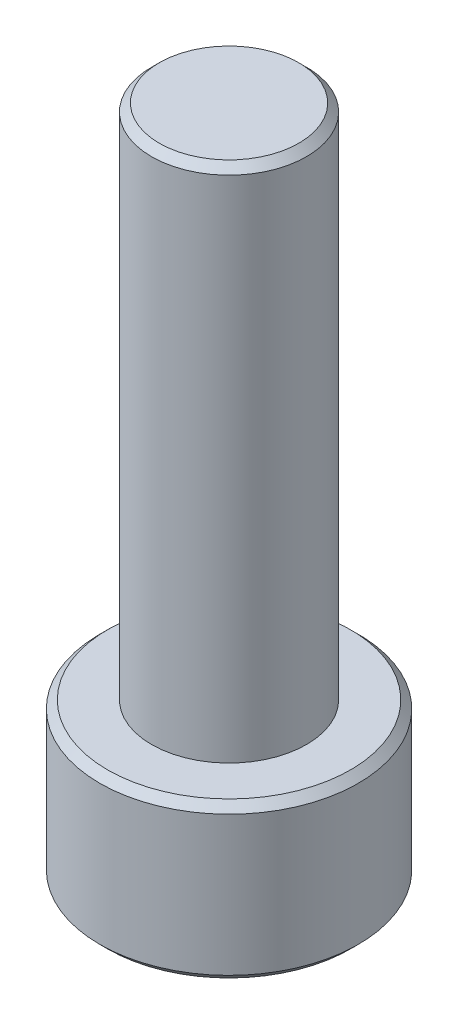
from build123d import *

# Parameters (mm, degrees)
SKETCH1_R           = 5
BOSS_EXTRUDE1_DEPTH = 6
SKETCH2_R           = 3
BOSS_EXTRUDE2_DEPTH = 20
CHAMFER1_SIZE       = 0.3
CHAMFER2_SIZE       = 0.3
CUT_EXTRUDE1_DEPTH  = 3


with BuildPart() as part:
    # Sketch1 → Boss-Extrude1 (new body)
    with BuildSketch(Plane(origin=(0, 0, 0), x_dir=(1, 0, 0), z_dir=(0, 1, 0))):
        with Locations(Location((0, 0, 0), (0, 0, 270))):
            Circle(SKETCH1_R)
    extrude(amount=BOSS_EXTRUDE1_DEPTH)

    # Sketch2 → Boss-Extrude2 (add)
    with BuildSketch(Plane(origin=(0, 6, 0), x_dir=(1, 0, 0), z_dir=(0, 1, 0))):
        with Locations(Location((0, 0, 0), (0, 0, 270))):
            Circle(SKETCH2_R)
    extrude(amount=BOSS_EXTRUDE2_DEPTH)

    # Chamfer1
    chamfer1_edges = [part.edges().sort_by_distance(p)[0] for p in [
        (0, 0, -5),
        (0, 6, -5),
    ]]
    chamfer(chamfer1_edges, length=CHAMFER1_SIZE)

    # Chamfer2
    chamfer2_edges = [part.edges().sort_by_distance(p)[0] for p in [
        (0, 26, -3),
    ]]
    chamfer(chamfer2_edges, length=CHAMFER2_SIZE)

    # Sketch3 → Cut-Extrude1 (cut)
    with BuildSketch(Plane.XZ):
        Polygon((2.886751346, 0), (1.443375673, 2.5), (-1.443375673, 2.5), (-2.886751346, 0), (-1.443375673, -2.5), (1.443375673, -2.5), align=None)
    extrude(amount=-CUT_EXTRUDE1_DEPTH, mode=Mode.SUBTRACT)


solid = part.part
